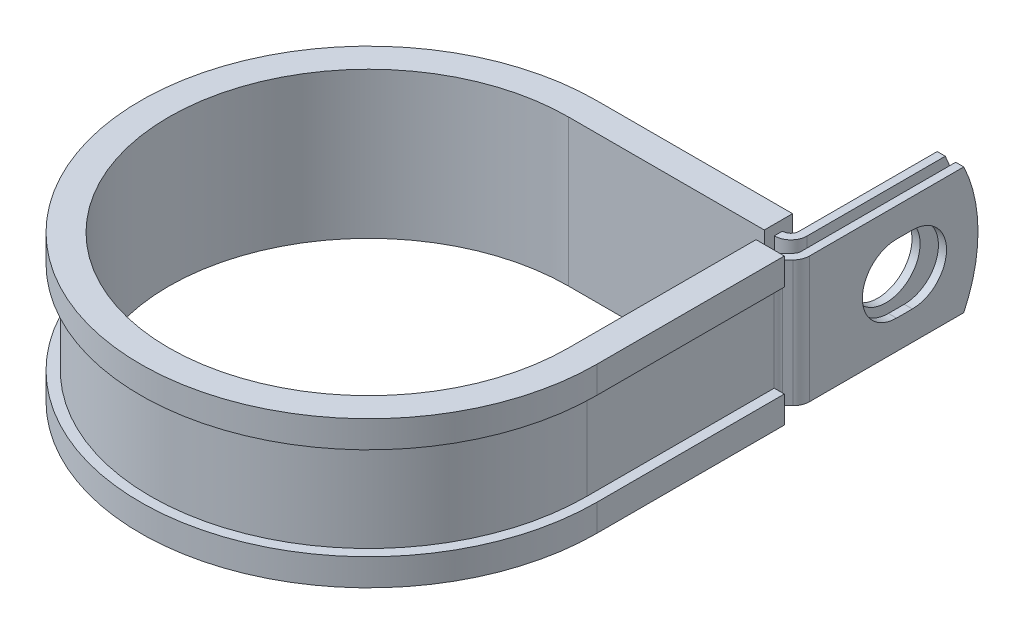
ISO-10303-21;
HEADER;
FILE_DESCRIPTION(('STEP AP214'),'2;1');
FILE_NAME('part.step','',(''),(''),'','','');
FILE_SCHEMA(('AUTOMOTIVE_DESIGN { 1 0 10303 214 1 1 1 1 }'));
ENDSEC;
DATA;
#1=APPLICATION_CONTEXT('core data for automotive mechanical design processes');
#2=APPLICATION_PROTOCOL_DEFINITION('international standard','automotive_design',2000,#1);
#3=PRODUCT_CONTEXT('',#1,'mechanical');
#4=PRODUCT('Part','Part','',(#3));
#5=PRODUCT_RELATED_PRODUCT_CATEGORY('part','',(#4));
#6=PRODUCT_DEFINITION_FORMATION('','',#4);
#7=PRODUCT_DEFINITION_CONTEXT('part definition',#1,'design');
#8=PRODUCT_DEFINITION('design','',#6,#7);
#9=PRODUCT_DEFINITION_SHAPE('','',#8);
#10=(LENGTH_UNIT() NAMED_UNIT(*) SI_UNIT(.MILLI.,.METRE.));
#11=(NAMED_UNIT(*) PLANE_ANGLE_UNIT() SI_UNIT($,.RADIAN.));
#12=(NAMED_UNIT(*) SI_UNIT($,.STERADIAN.) SOLID_ANGLE_UNIT());
#13=UNCERTAINTY_MEASURE_WITH_UNIT(LENGTH_MEASURE(1.E-05),#10,'distance_accuracy_value','');
#14=(GEOMETRIC_REPRESENTATION_CONTEXT(3) GLOBAL_UNCERTAINTY_ASSIGNED_CONTEXT((#13)) GLOBAL_UNIT_ASSIGNED_CONTEXT((#10,
#11,#12)) REPRESENTATION_CONTEXT('',''));
#15=CARTESIAN_POINT('',(0.,0.,0.));
#16=DIRECTION('',(0.,0.,1.));
#17=DIRECTION('',(1.,0.,0.));
#18=AXIS2_PLACEMENT_3D('',#15,#16,#17);
#19=CARTESIAN_POINT('',(32.3647698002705,-9.525,-31.6865));
#20=DIRECTION('',(0.,1.,0.));
#21=DIRECTION('',(1.,0.,0.));
#22=AXIS2_PLACEMENT_3D('',#19,#20,#21);
#23=PLANE('',#22);
#24=DIRECTION('',(0.,0.,-1.));
#25=VECTOR('',#24,1.);
#26=CARTESIAN_POINT('',(29.5199698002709,-9.525,-31.6865));
#27=LINE('',#26,#25);
#28=CARTESIAN_POINT('',(29.5199698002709,-9.525,-31.6865));
#29=VERTEX_POINT('',#28);
#30=CARTESIAN_POINT('',(29.5199698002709,-9.525,-32.9057));
#31=VERTEX_POINT('',#30);
#32=EDGE_CURVE('E523',#29,#31,#27,.T.);
#33=ORIENTED_EDGE('',*,*,#32,.T.);
#34=DIRECTION('',(1.,0.,0.));
#35=VECTOR('',#34,1.);
#36=CARTESIAN_POINT('',(0.,-9.525,-32.9057));
#37=LINE('',#36,#35);
#38=CARTESIAN_POINT('',(29.5707698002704,-9.525,-32.9057));
#39=VERTEX_POINT('',#38);
#40=EDGE_CURVE('E410',#39,#31,#37,.F.);
#41=ORIENTED_EDGE('',*,*,#40,.F.);
#42=CARTESIAN_POINT('',(29.5707698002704,-9.525,-34.1249));
#43=DIRECTION('',(0.,1.,0.));
#44=DIRECTION('',(1.,0.,0.));
#45=AXIS2_PLACEMENT_3D('',#42,#43,#44);
#46=CIRCLE('',#45,1.2192);
#47=CARTESIAN_POINT('',(30.7899698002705,-9.525,-34.1249));
#48=VERTEX_POINT('',#47);
#49=EDGE_CURVE('E408',#48,#39,#46,.F.);
#50=ORIENTED_EDGE('',*,*,#49,.F.);
#51=DIRECTION('',(0.,0.,1.));
#52=VECTOR('',#51,1.);
#53=CARTESIAN_POINT('',(30.7899698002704,-9.525,-57.1246));
#54=LINE('',#53,#52);
#55=CARTESIAN_POINT('',(30.7899698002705,-9.525,-54.9800631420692));
#56=VERTEX_POINT('',#55);
#57=EDGE_CURVE('E406',#56,#48,#54,.T.);
#58=ORIENTED_EDGE('',*,*,#57,.F.);
#59=DIRECTION('',(-1.,0.,0.));
#60=VECTOR('',#59,1.);
#61=CARTESIAN_POINT('',(34.8031698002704,-9.525,-54.9800631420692));
#62=LINE('',#61,#60);
#63=CARTESIAN_POINT('',(32.0091698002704,-9.525,-54.9800631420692));
#64=VERTEX_POINT('',#63);
#65=EDGE_CURVE('E12',#64,#56,#62,.T.);
#66=ORIENTED_EDGE('',*,*,#65,.F.);
#67=DIRECTION('',(0.,0.,1.));
#68=VECTOR('',#67,1.);
#69=CARTESIAN_POINT('',(32.0091698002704,-9.525,-57.1246));
#70=LINE('',#69,#68);
#71=CARTESIAN_POINT('',(32.0091698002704,-9.525,-34.1249));
#72=VERTEX_POINT('',#71);
#73=EDGE_CURVE('E404',#64,#72,#70,.T.);
#74=ORIENTED_EDGE('',*,*,#73,.T.);
#75=CARTESIAN_POINT('',(29.5707698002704,-9.525,-34.1249));
#76=DIRECTION('',(0.,-1.,0.));
#77=DIRECTION('',(0.,0.,1.));
#78=AXIS2_PLACEMENT_3D('',#75,#76,#77);
#79=CIRCLE('',#78,2.4384);
#80=CARTESIAN_POINT('',(29.5707698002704,-9.525,-31.6865));
#81=VERTEX_POINT('',#80);
#82=EDGE_CURVE('E401',#72,#81,#79,.T.);
#83=ORIENTED_EDGE('',*,*,#82,.T.);
#84=DIRECTION('',(-1.,0.,0.));
#85=VECTOR('',#84,1.);
#86=CARTESIAN_POINT('',(0.,-9.525,-31.6865));
#87=LINE('',#86,#85);
#88=EDGE_CURVE('E398',#81,#29,#87,.T.);
#89=ORIENTED_EDGE('',*,*,#88,.T.);
#90=EDGE_LOOP('',(#33,#41,#50,#58,#66,#74,#83,#89));
#91=FACE_BOUND('',#90,.T.);
#92=ADVANCED_FACE('F54',(#91),#23,.F.);
#93=CARTESIAN_POINT('',(32.3647698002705,9.525,-31.6865));
#94=DIRECTION('',(0.,1.,0.));
#95=DIRECTION('',(1.,0.,0.));
#96=AXIS2_PLACEMENT_3D('',#93,#94,#95);
#97=PLANE('',#96);
#98=DIRECTION('',(1.,0.,0.));
#99=VECTOR('',#98,1.);
#100=CARTESIAN_POINT('',(0.,9.525,-32.9057));
#101=LINE('',#100,#99);
#102=CARTESIAN_POINT('',(29.5707698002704,9.525,-32.9057));
#103=VERTEX_POINT('',#102);
#104=CARTESIAN_POINT('',(29.5199698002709,9.525,-32.9057));
#105=VERTEX_POINT('',#104);
#106=EDGE_CURVE('E368',#103,#105,#101,.F.);
#107=ORIENTED_EDGE('',*,*,#106,.T.);
#108=DIRECTION('',(0.,0.,1.));
#109=VECTOR('',#108,1.);
#110=CARTESIAN_POINT('',(29.5199698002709,9.525,-32.9057));
#111=LINE('',#110,#109);
#112=CARTESIAN_POINT('',(29.5199698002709,9.525,-31.6865));
#113=VERTEX_POINT('',#112);
#114=EDGE_CURVE('E517',#105,#113,#111,.T.);
#115=ORIENTED_EDGE('',*,*,#114,.T.);
#116=DIRECTION('',(-1.,0.,0.));
#117=VECTOR('',#116,1.);
#118=CARTESIAN_POINT('',(0.,9.525,-31.6865));
#119=LINE('',#118,#117);
#120=CARTESIAN_POINT('',(29.5707698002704,9.525,-31.6865));
#121=VERTEX_POINT('',#120);
#122=EDGE_CURVE('E625',#121,#113,#119,.T.);
#123=ORIENTED_EDGE('',*,*,#122,.F.);
#124=CARTESIAN_POINT('',(29.5707698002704,9.525,-34.1249));
#125=DIRECTION('',(0.,-1.,0.));
#126=DIRECTION('',(0.,0.,1.));
#127=AXIS2_PLACEMENT_3D('',#124,#125,#126);
#128=CIRCLE('',#127,2.4384);
#129=CARTESIAN_POINT('',(32.0091698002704,9.525,-34.1249));
#130=VERTEX_POINT('',#129);
#131=EDGE_CURVE('E370',#130,#121,#128,.T.);
#132=ORIENTED_EDGE('',*,*,#131,.F.);
#133=DIRECTION('',(0.,0.,1.));
#134=VECTOR('',#133,1.);
#135=CARTESIAN_POINT('',(32.0091698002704,9.525,-57.1246));
#136=LINE('',#135,#134);
#137=CARTESIAN_POINT('',(32.0091698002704,9.525,-54.9800631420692));
#138=VERTEX_POINT('',#137);
#139=EDGE_CURVE('E361',#138,#130,#136,.T.);
#140=ORIENTED_EDGE('',*,*,#139,.F.);
#141=DIRECTION('',(-1.,0.,0.));
#142=VECTOR('',#141,1.);
#143=CARTESIAN_POINT('',(34.8031698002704,9.525,-54.9800631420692));
#144=LINE('',#143,#142);
#145=CARTESIAN_POINT('',(30.7899698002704,9.525,-54.9800631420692));
#146=VERTEX_POINT('',#145);
#147=EDGE_CURVE('E62',#138,#146,#144,.T.);
#148=ORIENTED_EDGE('',*,*,#147,.T.);
#149=DIRECTION('',(0.,0.,1.));
#150=VECTOR('',#149,1.);
#151=CARTESIAN_POINT('',(30.7899698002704,9.525,-57.1246));
#152=LINE('',#151,#150);
#153=CARTESIAN_POINT('',(30.7899698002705,9.525,-34.1249));
#154=VERTEX_POINT('',#153);
#155=EDGE_CURVE('E358',#146,#154,#152,.T.);
#156=ORIENTED_EDGE('',*,*,#155,.T.);
#157=CARTESIAN_POINT('',(29.5707698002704,9.525,-34.1249));
#158=DIRECTION('',(0.,1.,0.));
#159=DIRECTION('',(1.,0.,0.));
#160=AXIS2_PLACEMENT_3D('',#157,#158,#159);
#161=CIRCLE('',#160,1.2192);
#162=EDGE_CURVE('E366',#154,#103,#161,.F.);
#163=ORIENTED_EDGE('',*,*,#162,.T.);
#164=EDGE_LOOP('',(#107,#115,#123,#132,#140,#148,#156,#163));
#165=FACE_BOUND('',#164,.T.);
#166=ADVANCED_FACE('F357',(#165),#97,.T.);
#167=CARTESIAN_POINT('',(0.,9.525,-31.6865));
#168=DIRECTION('',(0.,0.,1.));
#169=DIRECTION('',(1.,0.,0.));
#170=AXIS2_PLACEMENT_3D('',#167,#168,#169);
#171=PLANE('',#170);
#172=ORIENTED_EDGE('',*,*,#122,.T.);
#173=DIRECTION('',(0.,-1.,0.));
#174=VECTOR('',#173,1.);
#175=CARTESIAN_POINT('',(29.5199698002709,9.525,-31.6865));
#176=LINE('',#175,#174);
#177=EDGE_CURVE('E520',#113,#29,#176,.T.);
#178=ORIENTED_EDGE('',*,*,#177,.T.);
#179=ORIENTED_EDGE('',*,*,#88,.F.);
#180=DIRECTION('',(0.,-1.,0.));
#181=VECTOR('',#180,1.);
#182=CARTESIAN_POINT('',(29.5707698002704,9.525,-31.6865));
#183=LINE('',#182,#181);
#184=EDGE_CURVE('E344',#121,#81,#183,.T.);
#185=ORIENTED_EDGE('',*,*,#184,.F.);
#186=EDGE_LOOP('',(#172,#178,#179,#185));
#187=FACE_BOUND('',#186,.T.);
#188=ADVANCED_FACE('F635',(#187),#171,.T.);
#189=CARTESIAN_POINT('',(34.8031698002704,9.525,-31.6865));
#190=DIRECTION('',(-1.,0.,0.));
#191=DIRECTION('',(0.,0.,1.));
#192=AXIS2_PLACEMENT_3D('',#189,#190,#191);
#193=PLANE('',#192);
#194=CARTESIAN_POINT('',(34.8031698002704,0.,-47.2185999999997));
#195=DIRECTION('',(1.,0.,0.));
#196=DIRECTION('',(0.,0.,-1.));
#197=AXIS2_PLACEMENT_3D('',#194,#195,#196);
#198=CIRCLE('',#197,5.1562);
#199=CARTESIAN_POINT('',(34.8031698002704,-5.1562,-47.2186000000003));
#200=VERTEX_POINT('',#199);
#201=CARTESIAN_POINT('',(34.8031698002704,5.1562,-47.2186000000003));
#202=VERTEX_POINT('',#201);
#203=EDGE_CURVE('E580',#200,#202,#198,.T.);
#204=ORIENTED_EDGE('',*,*,#203,.F.);
#205=DIRECTION('',(0.,0.,-1.));
#206=VECTOR('',#205,1.);
#207=CARTESIAN_POINT('',(34.8031698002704,-5.1562,-44.8309999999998));
#208=LINE('',#207,#206);
#209=CARTESIAN_POINT('',(34.8031698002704,-5.1562,-44.8309999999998));
#210=VERTEX_POINT('',#209);
#211=EDGE_CURVE('E583',#210,#200,#208,.T.);
#212=ORIENTED_EDGE('',*,*,#211,.F.);
#213=CARTESIAN_POINT('',(34.8031698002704,0.,-44.8309999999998));
#214=DIRECTION('',(1.,0.,0.));
#215=DIRECTION('',(0.,0.,-1.));
#216=AXIS2_PLACEMENT_3D('',#213,#214,#215);
#217=CIRCLE('',#216,5.1562);
#218=CARTESIAN_POINT('',(34.8031698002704,5.1562,-44.8309999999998));
#219=VERTEX_POINT('',#218);
#220=EDGE_CURVE('E576',#219,#210,#217,.T.);
#221=ORIENTED_EDGE('',*,*,#220,.F.);
#222=DIRECTION('',(0.,0.,1.));
#223=VECTOR('',#222,1.);
#224=CARTESIAN_POINT('',(34.8031698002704,5.1562,-44.8309999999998));
#225=LINE('',#224,#223);
#226=EDGE_CURVE('E577',#202,#219,#225,.T.);
#227=ORIENTED_EDGE('',*,*,#226,.F.);
#228=EDGE_LOOP('',(#204,#212,#221,#227));
#229=FACE_BOUND('',#228,.T.);
#230=DIRECTION('',(0.,0.,-1.));
#231=VECTOR('',#230,1.);
#232=CARTESIAN_POINT('',(34.8031698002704,-9.525,-31.6865));
#233=LINE('',#232,#231);
#234=CARTESIAN_POINT('',(34.8031698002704,-9.525,-31.6865));
#235=VERTEX_POINT('',#234);
#236=CARTESIAN_POINT('',(34.8031698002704,-9.525,-54.9800631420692));
#237=VERTEX_POINT('',#236);
#238=EDGE_CURVE('E382',#235,#237,#233,.T.);
#239=ORIENTED_EDGE('',*,*,#238,.T.);
#240=CARTESIAN_POINT('',(34.8031698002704,0.,-34.8996));
#241=DIRECTION('',(-1.,0.,0.));
#242=DIRECTION('',(0.,0.,1.));
#243=AXIS2_PLACEMENT_3D('',#240,#241,#242);
#244=CIRCLE('',#243,22.225);
#245=CARTESIAN_POINT('',(34.8031698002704,9.525,-54.9800631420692));
#246=VERTEX_POINT('',#245);
#247=EDGE_CURVE('E568',#246,#237,#244,.T.);
#248=ORIENTED_EDGE('',*,*,#247,.F.);
#249=DIRECTION('',(0.,0.,-1.));
#250=VECTOR('',#249,1.);
#251=CARTESIAN_POINT('',(34.8031698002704,9.525,-31.6865));
#252=LINE('',#251,#250);
#253=CARTESIAN_POINT('',(34.8031698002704,9.525,-31.6865));
#254=VERTEX_POINT('',#253);
#255=EDGE_CURVE('E419',#254,#246,#252,.T.);
#256=ORIENTED_EDGE('',*,*,#255,.F.);
#257=DIRECTION('',(0.,-1.,0.));
#258=VECTOR('',#257,1.);
#259=CARTESIAN_POINT('',(34.8031698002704,9.525,-31.6865));
#260=LINE('',#259,#258);
#261=EDGE_CURVE('E381',#254,#235,#260,.T.);
#262=ORIENTED_EDGE('',*,*,#261,.T.);
#263=EDGE_LOOP('',(#239,#248,#256,#262));
#264=FACE_BOUND('',#263,.T.);
#265=ADVANCED_FACE('F56',(#229,#264),#193,.F.);
#266=CARTESIAN_POINT('',(33.5839698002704,9.525,-31.6865));
#267=DIRECTION('',(-1.,0.,0.));
#268=DIRECTION('',(0.,0.,1.));
#269=AXIS2_PLACEMENT_3D('',#266,#267,#268);
#270=PLANE('',#269);
#271=DIRECTION('',(0.,0.,-1.));
#272=VECTOR('',#271,1.);
#273=CARTESIAN_POINT('',(33.5839698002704,-5.1562,-44.8309999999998));
#274=LINE('',#273,#272);
#275=CARTESIAN_POINT('',(33.5839698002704,-5.1562,-44.8309999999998));
#276=VERTEX_POINT('',#275);
#277=CARTESIAN_POINT('',(33.5839698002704,-5.1562,-47.2186000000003));
#278=VERTEX_POINT('',#277);
#279=EDGE_CURVE('E579',#276,#278,#274,.T.);
#280=ORIENTED_EDGE('',*,*,#279,.T.);
#281=CARTESIAN_POINT('',(33.5839698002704,0.,-47.2185999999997));
#282=DIRECTION('',(-1.,0.,0.));
#283=DIRECTION('',(0.,0.,1.));
#284=AXIS2_PLACEMENT_3D('',#281,#282,#283);
#285=CIRCLE('',#284,5.1562);
#286=CARTESIAN_POINT('',(33.5839698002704,5.1562,-47.2186000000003));
#287=VERTEX_POINT('',#286);
#288=EDGE_CURVE('E600',#278,#287,#285,.F.);
#289=ORIENTED_EDGE('',*,*,#288,.T.);
#290=DIRECTION('',(0.,0.,1.));
#291=VECTOR('',#290,1.);
#292=CARTESIAN_POINT('',(33.5839698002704,5.1562,-44.8309999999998));
#293=LINE('',#292,#291);
#294=CARTESIAN_POINT('',(33.5839698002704,5.1562,-44.8309999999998));
#295=VERTEX_POINT('',#294);
#296=EDGE_CURVE('E596',#287,#295,#293,.T.);
#297=ORIENTED_EDGE('',*,*,#296,.T.);
#298=CARTESIAN_POINT('',(33.5839698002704,0.,-44.8309999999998));
#299=DIRECTION('',(-1.,0.,0.));
#300=DIRECTION('',(0.,0.,1.));
#301=AXIS2_PLACEMENT_3D('',#298,#299,#300);
#302=CIRCLE('',#301,5.1562);
#303=EDGE_CURVE('E591',#295,#276,#302,.F.);
#304=ORIENTED_EDGE('',*,*,#303,.T.);
#305=EDGE_LOOP('',(#280,#289,#297,#304));
#306=FACE_BOUND('',#305,.T.);
#307=CARTESIAN_POINT('',(33.5839698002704,0.,-34.8996));
#308=DIRECTION('',(-1.,0.,0.));
#309=DIRECTION('',(0.,0.,1.));
#310=AXIS2_PLACEMENT_3D('',#307,#308,#309);
#311=CIRCLE('',#310,22.225);
#312=CARTESIAN_POINT('',(33.5839698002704,9.525,-54.9800631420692));
#313=VERTEX_POINT('',#312);
#314=CARTESIAN_POINT('',(33.5839698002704,-9.525,-54.9800631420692));
#315=VERTEX_POINT('',#314);
#316=EDGE_CURVE('E76',#313,#315,#311,.T.);
#317=ORIENTED_EDGE('',*,*,#316,.T.);
#318=DIRECTION('',(0.,0.,-1.));
#319=VECTOR('',#318,1.);
#320=CARTESIAN_POINT('',(33.5839698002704,-9.525,-31.6865));
#321=LINE('',#320,#319);
#322=CARTESIAN_POINT('',(33.5839698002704,-9.525,-31.6865));
#323=VERTEX_POINT('',#322);
#324=EDGE_CURVE('E385',#323,#315,#321,.T.);
#325=ORIENTED_EDGE('',*,*,#324,.F.);
#326=DIRECTION('',(0.,-1.,0.));
#327=VECTOR('',#326,1.);
#328=CARTESIAN_POINT('',(33.5839698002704,9.525,-31.6865));
#329=LINE('',#328,#327);
#330=CARTESIAN_POINT('',(33.5839698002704,9.525,-31.6865));
#331=VERTEX_POINT('',#330);
#332=EDGE_CURVE('E352',#331,#323,#329,.T.);
#333=ORIENTED_EDGE('',*,*,#332,.F.);
#334=DIRECTION('',(0.,0.,-1.));
#335=VECTOR('',#334,1.);
#336=CARTESIAN_POINT('',(33.5839698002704,9.525,-31.6865));
#337=LINE('',#336,#335);
#338=EDGE_CURVE('E615',#331,#313,#337,.T.);
#339=ORIENTED_EDGE('',*,*,#338,.T.);
#340=EDGE_LOOP('',(#317,#325,#333,#339));
#341=FACE_BOUND('',#340,.T.);
#342=ADVANCED_FACE('F689',(#306,#341),#270,.T.);
#343=CARTESIAN_POINT('',(32.0091698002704,9.525,-57.1246));
#344=DIRECTION('',(1.,0.,0.));
#345=DIRECTION('',(0.,0.,-1.));
#346=AXIS2_PLACEMENT_3D('',#343,#344,#345);
#347=PLANE('',#346);
#348=CARTESIAN_POINT('',(32.0091698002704,0.,-46.0248));
#349=DIRECTION('',(1.,0.,0.));
#350=DIRECTION('',(0.,0.,-1.));
#351=AXIS2_PLACEMENT_3D('',#348,#349,#350);
#352=CIRCLE('',#351,5.1562);
#353=CARTESIAN_POINT('',(32.0091698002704,0.,-51.181));
#354=VERTEX_POINT('',#353);
#355=EDGE_CURVE('E386',#354,#354,#352,.F.);
#356=ORIENTED_EDGE('',*,*,#355,.T.);
#357=EDGE_LOOP('',(#356));
#358=FACE_BOUND('',#357,.T.);
#359=ORIENTED_EDGE('',*,*,#73,.F.);
#360=CARTESIAN_POINT('',(32.0091698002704,0.,-34.8996));
#361=DIRECTION('',(1.,0.,0.));
#362=DIRECTION('',(0.,0.,-1.));
#363=AXIS2_PLACEMENT_3D('',#360,#361,#362);
#364=CIRCLE('',#363,22.225);
#365=EDGE_CURVE('E573',#64,#138,#364,.T.);
#366=ORIENTED_EDGE('',*,*,#365,.T.);
#367=ORIENTED_EDGE('',*,*,#139,.T.);
#368=DIRECTION('',(0.,-1.,0.));
#369=VECTOR('',#368,1.);
#370=CARTESIAN_POINT('',(32.0091698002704,9.525,-34.1249));
#371=LINE('',#370,#369);
#372=EDGE_CURVE('E341',#130,#72,#371,.T.);
#373=ORIENTED_EDGE('',*,*,#372,.T.);
#374=EDGE_LOOP('',(#359,#366,#367,#373));
#375=FACE_BOUND('',#374,.T.);
#376=ADVANCED_FACE('F641',(#358,#375),#347,.T.);
#377=CARTESIAN_POINT('',(30.7899698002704,9.525,-57.1246));
#378=DIRECTION('',(1.,0.,0.));
#379=DIRECTION('',(0.,0.,-1.));
#380=AXIS2_PLACEMENT_3D('',#377,#378,#379);
#381=PLANE('',#380);
#382=CARTESIAN_POINT('',(30.7899698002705,0.,-46.0248));
#383=DIRECTION('',(-1.,0.,0.));
#384=DIRECTION('',(0.,0.,1.));
#385=AXIS2_PLACEMENT_3D('',#382,#383,#384);
#386=CIRCLE('',#385,5.1562);
#387=CARTESIAN_POINT('',(30.7899698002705,0.,-40.8686));
#388=VERTEX_POINT('',#387);
#389=EDGE_CURVE('E608',#388,#388,#386,.T.);
#390=ORIENTED_EDGE('',*,*,#389,.F.);
#391=EDGE_LOOP('',(#390));
#392=FACE_BOUND('',#391,.T.);
#393=CARTESIAN_POINT('',(30.7899698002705,0.,-34.8996));
#394=DIRECTION('',(-1.,0.,0.));
#395=DIRECTION('',(0.,0.,1.));
#396=AXIS2_PLACEMENT_3D('',#393,#394,#395);
#397=CIRCLE('',#396,22.225);
#398=EDGE_CURVE('E68',#146,#56,#397,.T.);
#399=ORIENTED_EDGE('',*,*,#398,.T.);
#400=ORIENTED_EDGE('',*,*,#57,.T.);
#401=DIRECTION('',(0.,-1.,0.));
#402=VECTOR('',#401,1.);
#403=CARTESIAN_POINT('',(30.7899698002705,9.525,-34.1249));
#404=LINE('',#403,#402);
#405=EDGE_CURVE('E338',#154,#48,#404,.T.);
#406=ORIENTED_EDGE('',*,*,#405,.F.);
#407=ORIENTED_EDGE('',*,*,#155,.F.);
#408=EDGE_LOOP('',(#399,#400,#406,#407));
#409=FACE_BOUND('',#408,.T.);
#410=ADVANCED_FACE('F364',(#392,#409),#381,.F.);
#411=CARTESIAN_POINT('',(34.1249,-9.525,-28.2740026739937));
#412=DIRECTION('',(0.,1.,0.));
#413=DIRECTION('',(1.,0.,0.));
#414=AXIS2_PLACEMENT_3D('',#411,#412,#413);
#415=CIRCLE('',#414,1.2192);
#416=CARTESIAN_POINT('',(32.9057,-9.525,-28.2740026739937));
#417=VERTEX_POINT('',#416);
#418=CARTESIAN_POINT('',(33.2627954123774,-9.525,-29.1361072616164));
#419=VERTEX_POINT('',#418);
#420=EDGE_CURVE('E413',#417,#419,#415,.F.);
#421=ORIENTED_EDGE('',*,*,#420,.F.);
#422=DIRECTION('',(1.,0.,0.));
#423=VECTOR('',#422,1.);
#424=CARTESIAN_POINT('',(31.6865,-9.525,-28.2740026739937));
#425=LINE('',#424,#423);
#426=CARTESIAN_POINT('',(31.6865,-9.525,-28.2740026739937));
#427=VERTEX_POINT('',#426);
#428=EDGE_CURVE('E451',#427,#417,#425,.T.);
#429=ORIENTED_EDGE('',*,*,#428,.F.);
#430=CARTESIAN_POINT('',(34.1249,-9.525,-28.2740026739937));
#431=DIRECTION('',(0.,-1.,0.));
#432=DIRECTION('',(0.,0.,1.));
#433=AXIS2_PLACEMENT_3D('',#430,#431,#432);
#434=CIRCLE('',#433,2.4384);
#435=CARTESIAN_POINT('',(32.4006908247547,-9.525,-29.998211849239));
#436=VERTEX_POINT('',#435);
#437=EDGE_CURVE('E395',#427,#436,#434,.T.);
#438=ORIENTED_EDGE('',*,*,#437,.T.);
#439=DIRECTION('',(0.707106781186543,0.,-0.707106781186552));
#440=VECTOR('',#439,1.);
#441=CARTESIAN_POINT('',(32.4006908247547,-9.525,-29.998211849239));
#442=LINE('',#441,#440);
#443=CARTESIAN_POINT('',(33.2268743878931,-9.525,-30.8243954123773));
#444=VERTEX_POINT('',#443);
#445=EDGE_CURVE('E392',#436,#444,#442,.T.);
#446=ORIENTED_EDGE('',*,*,#445,.T.);
#447=CARTESIAN_POINT('',(32.3647698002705,-9.525,-31.6865));
#448=DIRECTION('',(0.,1.,0.));
#449=DIRECTION('',(0.,0.,1.));
#450=AXIS2_PLACEMENT_3D('',#447,#448,#449);
#451=CIRCLE('',#450,1.21919999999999);
#452=EDGE_CURVE('E389',#444,#323,#451,.T.);
#453=ORIENTED_EDGE('',*,*,#452,.T.);
#454=ORIENTED_EDGE('',*,*,#324,.T.);
#455=DIRECTION('',(-1.,0.,0.));
#456=VECTOR('',#455,1.);
#457=CARTESIAN_POINT('',(34.8031698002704,-9.525,-54.9800631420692));
#458=LINE('',#457,#456);
#459=EDGE_CURVE('E566',#237,#315,#458,.T.);
#460=ORIENTED_EDGE('',*,*,#459,.F.);
#461=ORIENTED_EDGE('',*,*,#238,.F.);
#462=CARTESIAN_POINT('',(32.3647698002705,-9.525,-31.6865));
#463=DIRECTION('',(0.,1.,0.));
#464=DIRECTION('',(1.,0.,0.));
#465=AXIS2_PLACEMENT_3D('',#462,#463,#464);
#466=CIRCLE('',#465,2.43839999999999);
#467=CARTESIAN_POINT('',(34.0889789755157,-9.525,-29.9622908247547));
#468=VERTEX_POINT('',#467);
#469=EDGE_CURVE('E417',#468,#235,#466,.T.);
#470=ORIENTED_EDGE('',*,*,#469,.F.);
#471=DIRECTION('',(0.707106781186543,0.,-0.707106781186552));
#472=VECTOR('',#471,1.);
#473=CARTESIAN_POINT('',(33.2627954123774,-9.525,-29.1361072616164));
#474=LINE('',#473,#472);
#475=EDGE_CURVE('E415',#419,#468,#474,.T.);
#476=ORIENTED_EDGE('',*,*,#475,.F.);
#477=EDGE_LOOP('',(#421,#429,#438,#446,#453,#454,#460,#461,#470,#476));
#478=FACE_BOUND('',#477,.T.);
#479=ADVANCED_FACE('F675',(#478),#23,.F.);
#480=DIRECTION('',(-1.,0.,0.));
#481=VECTOR('',#480,1.);
#482=CARTESIAN_POINT('',(32.9057,9.525,-28.2740026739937));
#483=LINE('',#482,#481);
#484=CARTESIAN_POINT('',(32.9057,9.525,-28.2740026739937));
#485=VERTEX_POINT('',#484);
#486=CARTESIAN_POINT('',(31.6865,9.525,-28.2740026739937));
#487=VERTEX_POINT('',#486);
#488=EDGE_CURVE('E440',#485,#487,#483,.T.);
#489=ORIENTED_EDGE('',*,*,#488,.F.);
#490=CARTESIAN_POINT('',(34.1249,9.525,-28.2740026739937));
#491=DIRECTION('',(0.,1.,0.));
#492=DIRECTION('',(1.,0.,0.));
#493=AXIS2_PLACEMENT_3D('',#490,#491,#492);
#494=CIRCLE('',#493,1.2192);
#495=CARTESIAN_POINT('',(33.2627954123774,9.525,-29.1361072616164));
#496=VERTEX_POINT('',#495);
#497=EDGE_CURVE('E375',#485,#496,#494,.F.);
#498=ORIENTED_EDGE('',*,*,#497,.T.);
#499=DIRECTION('',(0.707106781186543,0.,-0.707106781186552));
#500=VECTOR('',#499,1.);
#501=CARTESIAN_POINT('',(33.2627954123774,9.525,-29.1361072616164));
#502=LINE('',#501,#500);
#503=CARTESIAN_POINT('',(34.0889789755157,9.525,-29.9622908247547));
#504=VERTEX_POINT('',#503);
#505=EDGE_CURVE('E377',#496,#504,#502,.T.);
#506=ORIENTED_EDGE('',*,*,#505,.T.);
#507=CARTESIAN_POINT('',(32.3647698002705,9.525,-31.6865));
#508=DIRECTION('',(0.,1.,0.));
#509=DIRECTION('',(1.,0.,0.));
#510=AXIS2_PLACEMENT_3D('',#507,#508,#509);
#511=CIRCLE('',#510,2.43839999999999);
#512=EDGE_CURVE('E379',#504,#254,#511,.T.);
#513=ORIENTED_EDGE('',*,*,#512,.T.);
#514=ORIENTED_EDGE('',*,*,#255,.T.);
#515=DIRECTION('',(-1.,0.,0.));
#516=VECTOR('',#515,1.);
#517=CARTESIAN_POINT('',(34.8031698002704,9.525,-54.9800631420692));
#518=LINE('',#517,#516);
#519=EDGE_CURVE('E570',#246,#313,#518,.T.);
#520=ORIENTED_EDGE('',*,*,#519,.T.);
#521=ORIENTED_EDGE('',*,*,#338,.F.);
#522=CARTESIAN_POINT('',(32.3647698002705,9.525,-31.6865));
#523=DIRECTION('',(0.,1.,0.));
#524=DIRECTION('',(0.,0.,1.));
#525=AXIS2_PLACEMENT_3D('',#522,#523,#524);
#526=CIRCLE('',#525,1.21919999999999);
#527=CARTESIAN_POINT('',(33.2268743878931,9.525,-30.8243954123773));
#528=VERTEX_POINT('',#527);
#529=EDGE_CURVE('E618',#528,#331,#526,.T.);
#530=ORIENTED_EDGE('',*,*,#529,.F.);
#531=DIRECTION('',(0.707106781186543,0.,-0.707106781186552));
#532=VECTOR('',#531,1.);
#533=CARTESIAN_POINT('',(32.4006908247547,9.525,-29.998211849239));
#534=LINE('',#533,#532);
#535=CARTESIAN_POINT('',(32.4006908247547,9.525,-29.998211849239));
#536=VERTEX_POINT('',#535);
#537=EDGE_CURVE('E621',#536,#528,#534,.T.);
#538=ORIENTED_EDGE('',*,*,#537,.F.);
#539=CARTESIAN_POINT('',(34.1249,9.525,-28.2740026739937));
#540=DIRECTION('',(0.,-1.,0.));
#541=DIRECTION('',(0.,0.,1.));
#542=AXIS2_PLACEMENT_3D('',#539,#540,#541);
#543=CIRCLE('',#542,2.4384);
#544=EDGE_CURVE('E450',#487,#536,#543,.T.);
#545=ORIENTED_EDGE('',*,*,#544,.F.);
#546=EDGE_LOOP('',(#489,#498,#506,#513,#514,#520,#521,#530,#538,#545));
#547=FACE_BOUND('',#546,.T.);
#548=ADVANCED_FACE('F447',(#547),#97,.T.);
#549=CARTESIAN_POINT('',(32.3647698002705,9.525,-31.6865));
#550=DIRECTION('',(0.,-1.,0.));
#551=DIRECTION('',(0.,0.,-1.));
#552=AXIS2_PLACEMENT_3D('',#549,#550,#551);
#553=CYLINDRICAL_SURFACE('',#552,1.21919999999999);
#554=ORIENTED_EDGE('',*,*,#452,.F.);
#555=DIRECTION('',(0.,-1.,0.));
#556=VECTOR('',#555,1.);
#557=CARTESIAN_POINT('',(33.2268743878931,9.525,-30.8243954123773));
#558=LINE('',#557,#556);
#559=EDGE_CURVE('E350',#528,#444,#558,.T.);
#560=ORIENTED_EDGE('',*,*,#559,.F.);
#561=ORIENTED_EDGE('',*,*,#529,.T.);
#562=ORIENTED_EDGE('',*,*,#332,.T.);
#563=EDGE_LOOP('',(#554,#560,#561,#562));
#564=FACE_BOUND('',#563,.T.);
#565=ADVANCED_FACE('F685',(#564),#553,.F.);
#566=CARTESIAN_POINT('',(32.4006908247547,9.525,-29.998211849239));
#567=DIRECTION('',(-0.707106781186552,0.,-0.707106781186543));
#568=DIRECTION('',(-0.707106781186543,0.,0.707106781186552));
#569=AXIS2_PLACEMENT_3D('',#566,#567,#568);
#570=PLANE('',#569);
#571=ORIENTED_EDGE('',*,*,#445,.F.);
#572=DIRECTION('',(0.,-1.,0.));
#573=VECTOR('',#572,1.);
#574=CARTESIAN_POINT('',(32.4006908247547,9.525,-29.998211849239));
#575=LINE('',#574,#573);
#576=EDGE_CURVE('E348',#536,#436,#575,.T.);
#577=ORIENTED_EDGE('',*,*,#576,.F.);
#578=ORIENTED_EDGE('',*,*,#537,.T.);
#579=ORIENTED_EDGE('',*,*,#559,.T.);
#580=EDGE_LOOP('',(#571,#577,#578,#579));
#581=FACE_BOUND('',#580,.T.);
#582=ADVANCED_FACE('F680',(#581),#570,.T.);
#583=CARTESIAN_POINT('',(34.1249,9.525,-28.2740026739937));
#584=DIRECTION('',(0.,-1.,0.));
#585=DIRECTION('',(0.,0.,-1.));
#586=AXIS2_PLACEMENT_3D('',#583,#584,#585);
#587=CYLINDRICAL_SURFACE('',#586,2.4384);
#588=ORIENTED_EDGE('',*,*,#437,.F.);
#589=DIRECTION('',(0.,-1.,0.));
#590=VECTOR('',#589,1.);
#591=CARTESIAN_POINT('',(31.6865,9.525,-28.2740026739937));
#592=LINE('',#591,#590);
#593=EDGE_CURVE('E346',#487,#427,#592,.T.);
#594=ORIENTED_EDGE('',*,*,#593,.F.);
#595=ORIENTED_EDGE('',*,*,#544,.T.);
#596=ORIENTED_EDGE('',*,*,#576,.T.);
#597=EDGE_LOOP('',(#588,#594,#595,#596));
#598=FACE_BOUND('',#597,.T.);
#599=ADVANCED_FACE('F677',(#598),#587,.T.);
#600=CARTESIAN_POINT('',(29.5707698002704,9.525,-34.1249));
#601=DIRECTION('',(0.,-1.,0.));
#602=DIRECTION('',(0.,0.,-1.));
#603=AXIS2_PLACEMENT_3D('',#600,#601,#602);
#604=CYLINDRICAL_SURFACE('',#603,2.4384);
#605=ORIENTED_EDGE('',*,*,#82,.F.);
#606=ORIENTED_EDGE('',*,*,#372,.F.);
#607=ORIENTED_EDGE('',*,*,#131,.T.);
#608=ORIENTED_EDGE('',*,*,#184,.T.);
#609=EDGE_LOOP('',(#605,#606,#607,#608));
#610=FACE_BOUND('',#609,.T.);
#611=ADVANCED_FACE('F631',(#610),#604,.T.);
#612=CARTESIAN_POINT('',(29.5707698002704,9.525,-34.1249));
#613=DIRECTION('',(0.,-1.,0.));
#614=DIRECTION('',(0.,0.,-1.));
#615=AXIS2_PLACEMENT_3D('',#612,#613,#614);
#616=CYLINDRICAL_SURFACE('',#615,1.2192);
#617=ORIENTED_EDGE('',*,*,#49,.T.);
#618=DIRECTION('',(0.,-1.,0.));
#619=VECTOR('',#618,1.);
#620=CARTESIAN_POINT('',(29.5707698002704,9.525,-32.9057));
#621=LINE('',#620,#619);
#622=EDGE_CURVE('E329',#103,#39,#621,.T.);
#623=ORIENTED_EDGE('',*,*,#622,.F.);
#624=ORIENTED_EDGE('',*,*,#162,.F.);
#625=ORIENTED_EDGE('',*,*,#405,.T.);
#626=EDGE_LOOP('',(#617,#623,#624,#625));
#627=FACE_BOUND('',#626,.T.);
#628=ADVANCED_FACE('F646',(#627),#616,.F.);
#629=CARTESIAN_POINT('',(0.,9.525,-32.9057));
#630=DIRECTION('',(0.,0.,1.));
#631=DIRECTION('',(1.,0.,0.));
#632=AXIS2_PLACEMENT_3D('',#629,#630,#631);
#633=PLANE('',#632);
#634=DIRECTION('',(0.,-1.,0.));
#635=VECTOR('',#634,1.);
#636=CARTESIAN_POINT('',(0.,9.525,-32.9057));
#637=LINE('',#636,#635);
#638=CARTESIAN_POINT('',(4.61573442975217E-13,6.985,-32.9057));
#639=VERTEX_POINT('',#638);
#640=CARTESIAN_POINT('',(4.61573442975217E-13,-6.985,-32.9057));
#641=VERTEX_POINT('',#640);
#642=EDGE_CURVE('E320',#639,#641,#637,.T.);
#643=ORIENTED_EDGE('',*,*,#642,.F.);
#644=DIRECTION('',(1.,0.,0.));
#645=VECTOR('',#644,1.);
#646=CARTESIAN_POINT('',(4.61573442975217E-13,6.985,-32.9057));
#647=LINE('',#646,#645);
#648=CARTESIAN_POINT('',(29.5199698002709,6.985,-32.9057));
#649=VERTEX_POINT('',#648);
#650=EDGE_CURVE('E563',#639,#649,#647,.T.);
#651=ORIENTED_EDGE('',*,*,#650,.T.);
#652=DIRECTION('',(0.,1.,0.));
#653=VECTOR('',#652,1.);
#654=CARTESIAN_POINT('',(29.5199698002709,9.525,-32.9057));
#655=LINE('',#654,#653);
#656=EDGE_CURVE('E514',#649,#105,#655,.T.);
#657=ORIENTED_EDGE('',*,*,#656,.T.);
#658=ORIENTED_EDGE('',*,*,#106,.F.);
#659=ORIENTED_EDGE('',*,*,#622,.T.);
#660=ORIENTED_EDGE('',*,*,#40,.T.);
#661=DIRECTION('',(0.,1.,0.));
#662=VECTOR('',#661,1.);
#663=CARTESIAN_POINT('',(29.5199698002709,-9.525,-32.9057));
#664=LINE('',#663,#662);
#665=CARTESIAN_POINT('',(29.5199698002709,-6.985,-32.9057));
#666=VERTEX_POINT('',#665);
#667=EDGE_CURVE('E526',#31,#666,#664,.T.);
#668=ORIENTED_EDGE('',*,*,#667,.T.);
#669=DIRECTION('',(1.,0.,0.));
#670=VECTOR('',#669,1.);
#671=CARTESIAN_POINT('',(4.61573442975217E-13,-6.985,-32.9057));
#672=LINE('',#671,#670);
#673=EDGE_CURVE('E543',#641,#666,#672,.T.);
#674=ORIENTED_EDGE('',*,*,#673,.F.);
#675=EDGE_LOOP('',(#643,#651,#657,#658,#659,#660,#668,#674));
#676=FACE_BOUND('',#675,.T.);
#677=ADVANCED_FACE('F650',(#676),#633,.F.);
#678=CARTESIAN_POINT('',(0.,9.525,0.));
#679=DIRECTION('',(0.,-1.,0.));
#680=DIRECTION('',(0.,0.,-1.));
#681=AXIS2_PLACEMENT_3D('',#678,#679,#680);
#682=CYLINDRICAL_SURFACE('',#681,32.9057);
#683=DIRECTION('',(0.,-1.,0.));
#684=VECTOR('',#683,1.);
#685=CARTESIAN_POINT('',(32.9057,9.525,0.));
#686=LINE('',#685,#684);
#687=CARTESIAN_POINT('',(32.9057,6.985,0.));
#688=VERTEX_POINT('',#687);
#689=CARTESIAN_POINT('',(32.9057,-6.985,0.));
#690=VERTEX_POINT('',#689);
#691=EDGE_CURVE('E318',#688,#690,#686,.T.);
#692=ORIENTED_EDGE('',*,*,#691,.F.);
#693=CARTESIAN_POINT('',(0.,6.985,0.));
#694=DIRECTION('',(0.,-1.,0.));
#695=DIRECTION('',(0.,0.,-1.));
#696=AXIS2_PLACEMENT_3D('',#693,#694,#695);
#697=CIRCLE('',#696,32.9057);
#698=EDGE_CURVE('E512',#688,#639,#697,.T.);
#699=ORIENTED_EDGE('',*,*,#698,.T.);
#700=ORIENTED_EDGE('',*,*,#642,.T.);
#701=CARTESIAN_POINT('',(0.,-6.985,0.));
#702=DIRECTION('',(0.,-1.,0.));
#703=DIRECTION('',(0.,0.,-1.));
#704=AXIS2_PLACEMENT_3D('',#701,#702,#703);
#705=CIRCLE('',#704,32.9057);
#706=EDGE_CURVE('E301',#690,#641,#705,.T.);
#707=ORIENTED_EDGE('',*,*,#706,.F.);
#708=EDGE_LOOP('',(#692,#699,#700,#707));
#709=FACE_BOUND('',#708,.T.);
#710=ADVANCED_FACE('F316',(#709),#682,.T.);
#711=CARTESIAN_POINT('',(32.9057,9.525,0.));
#712=DIRECTION('',(-1.,0.,0.));
#713=DIRECTION('',(0.,0.,1.));
#714=AXIS2_PLACEMENT_3D('',#711,#712,#713);
#715=PLANE('',#714);
#716=DIRECTION('',(0.,-1.,0.));
#717=VECTOR('',#716,1.);
#718=CARTESIAN_POINT('',(32.9057,9.525,-28.2740026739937));
#719=LINE('',#718,#717);
#720=CARTESIAN_POINT('',(32.9057,6.985,-28.2740026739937));
#721=VERTEX_POINT('',#720);
#722=CARTESIAN_POINT('',(32.9057,-6.985,-28.2740026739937));
#723=VERTEX_POINT('',#722);
#724=EDGE_CURVE('E332',#721,#723,#719,.T.);
#725=ORIENTED_EDGE('',*,*,#724,.F.);
#726=DIRECTION('',(0.,0.,-1.));
#727=VECTOR('',#726,1.);
#728=CARTESIAN_POINT('',(32.9057,6.985,0.));
#729=LINE('',#728,#727);
#730=EDGE_CURVE('E326',#688,#721,#729,.T.);
#731=ORIENTED_EDGE('',*,*,#730,.F.);
#732=ORIENTED_EDGE('',*,*,#691,.T.);
#733=DIRECTION('',(0.,0.,-1.));
#734=VECTOR('',#733,1.);
#735=CARTESIAN_POINT('',(32.9057,-6.985,0.));
#736=LINE('',#735,#734);
#737=EDGE_CURVE('E297',#690,#723,#736,.T.);
#738=ORIENTED_EDGE('',*,*,#737,.T.);
#739=EDGE_LOOP('',(#725,#731,#732,#738));
#740=FACE_BOUND('',#739,.T.);
#741=ADVANCED_FACE('F325',(#740),#715,.F.);
#742=CARTESIAN_POINT('',(34.1249,9.525,-28.2740026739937));
#743=DIRECTION('',(0.,-1.,0.));
#744=DIRECTION('',(0.,0.,-1.));
#745=AXIS2_PLACEMENT_3D('',#742,#743,#744);
#746=CYLINDRICAL_SURFACE('',#745,1.2192);
#747=ORIENTED_EDGE('',*,*,#420,.T.);
#748=DIRECTION('',(0.,-1.,0.));
#749=VECTOR('',#748,1.);
#750=CARTESIAN_POINT('',(33.2627954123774,9.525,-29.1361072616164));
#751=LINE('',#750,#749);
#752=EDGE_CURVE('E424',#496,#419,#751,.T.);
#753=ORIENTED_EDGE('',*,*,#752,.F.);
#754=ORIENTED_EDGE('',*,*,#497,.F.);
#755=EDGE_CURVE('E327',#485,#721,#719,.T.);
#756=ORIENTED_EDGE('',*,*,#755,.T.);
#757=ORIENTED_EDGE('',*,*,#724,.T.);
#758=DIRECTION('',(0.,1.,0.));
#759=VECTOR('',#758,1.);
#760=CARTESIAN_POINT('',(32.9057,-9.525,-28.2740026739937));
#761=LINE('',#760,#759);
#762=EDGE_CURVE('E433',#417,#723,#761,.T.);
#763=ORIENTED_EDGE('',*,*,#762,.F.);
#764=EDGE_LOOP('',(#747,#753,#754,#756,#757,#763));
#765=FACE_BOUND('',#764,.T.);
#766=ADVANCED_FACE('F432',(#765),#746,.F.);
#767=CARTESIAN_POINT('',(33.2627954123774,9.525,-29.1361072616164));
#768=DIRECTION('',(-0.707106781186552,0.,-0.707106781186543));
#769=DIRECTION('',(-0.707106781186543,0.,0.707106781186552));
#770=AXIS2_PLACEMENT_3D('',#767,#768,#769);
#771=PLANE('',#770);
#772=ORIENTED_EDGE('',*,*,#475,.T.);
#773=DIRECTION('',(0.,-1.,0.));
#774=VECTOR('',#773,1.);
#775=CARTESIAN_POINT('',(34.0889789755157,9.525,-29.9622908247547));
#776=LINE('',#775,#774);
#777=EDGE_CURVE('E422',#504,#468,#776,.T.);
#778=ORIENTED_EDGE('',*,*,#777,.F.);
#779=ORIENTED_EDGE('',*,*,#505,.F.);
#780=ORIENTED_EDGE('',*,*,#752,.T.);
#781=EDGE_LOOP('',(#772,#778,#779,#780));
#782=FACE_BOUND('',#781,.T.);
#783=ADVANCED_FACE('F701',(#782),#771,.F.);
#784=CARTESIAN_POINT('',(32.3647698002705,9.525,-31.6865));
#785=DIRECTION('',(0.,-1.,0.));
#786=DIRECTION('',(0.,0.,-1.));
#787=AXIS2_PLACEMENT_3D('',#784,#785,#786);
#788=CYLINDRICAL_SURFACE('',#787,2.43839999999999);
#789=ORIENTED_EDGE('',*,*,#469,.T.);
#790=ORIENTED_EDGE('',*,*,#261,.F.);
#791=ORIENTED_EDGE('',*,*,#512,.F.);
#792=ORIENTED_EDGE('',*,*,#777,.T.);
#793=EDGE_LOOP('',(#789,#790,#791,#792));
#794=FACE_BOUND('',#793,.T.);
#795=ADVANCED_FACE('F699',(#794),#788,.T.);
#796=CARTESIAN_POINT('',(46.5931057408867,0.,-46.0248));
#797=DIRECTION('',(-1.,0.,0.));
#798=DIRECTION('',(0.,0.,1.));
#799=AXIS2_PLACEMENT_3D('',#796,#797,#798);
#800=CYLINDRICAL_SURFACE('',#799,5.1562);
#801=ORIENTED_EDGE('',*,*,#389,.T.);
#802=EDGE_LOOP('',(#801));
#803=FACE_BOUND('',#802,.T.);
#804=ORIENTED_EDGE('',*,*,#355,.F.);
#805=EDGE_LOOP('',(#804));
#806=FACE_BOUND('',#805,.T.);
#807=ADVANCED_FACE('F708',(#803,#806),#800,.F.);
#808=CARTESIAN_POINT('',(17.2243978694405,-5.1562,-44.8309999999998));
#809=DIRECTION('',(0.,-1.,0.));
#810=DIRECTION('',(0.,0.,-1.));
#811=AXIS2_PLACEMENT_3D('',#808,#809,#810);
#812=PLANE('',#811);
#813=DIRECTION('',(1.,0.,0.));
#814=VECTOR('',#813,1.);
#815=CARTESIAN_POINT('',(17.2243978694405,-5.1562,-44.8309999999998));
#816=LINE('',#815,#814);
#817=EDGE_CURVE('E594',#276,#210,#816,.T.);
#818=ORIENTED_EDGE('',*,*,#817,.T.);
#819=ORIENTED_EDGE('',*,*,#211,.T.);
#820=DIRECTION('',(1.,0.,0.));
#821=VECTOR('',#820,1.);
#822=CARTESIAN_POINT('',(17.2243978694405,-5.1562,-47.2186000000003));
#823=LINE('',#822,#821);
#824=EDGE_CURVE('E590',#278,#200,#823,.T.);
#825=ORIENTED_EDGE('',*,*,#824,.F.);
#826=ORIENTED_EDGE('',*,*,#279,.F.);
#827=EDGE_LOOP('',(#818,#819,#825,#826));
#828=FACE_BOUND('',#827,.T.);
#829=ADVANCED_FACE('F751',(#828),#812,.F.);
#830=CARTESIAN_POINT('',(17.2243978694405,0.,-47.2185999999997));
#831=DIRECTION('',(1.,0.,0.));
#832=DIRECTION('',(0.,0.,-1.));
#833=AXIS2_PLACEMENT_3D('',#830,#831,#832);
#834=CYLINDRICAL_SURFACE('',#833,5.1562);
#835=ORIENTED_EDGE('',*,*,#824,.T.);
#836=ORIENTED_EDGE('',*,*,#203,.T.);
#837=DIRECTION('',(1.,0.,0.));
#838=VECTOR('',#837,1.);
#839=CARTESIAN_POINT('',(17.2243978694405,5.1562,-47.2186000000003));
#840=LINE('',#839,#838);
#841=EDGE_CURVE('E599',#287,#202,#840,.T.);
#842=ORIENTED_EDGE('',*,*,#841,.F.);
#843=ORIENTED_EDGE('',*,*,#288,.F.);
#844=EDGE_LOOP('',(#835,#836,#842,#843));
#845=FACE_BOUND('',#844,.T.);
#846=ADVANCED_FACE('F755',(#845),#834,.F.);
#847=CARTESIAN_POINT('',(17.2243978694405,5.1562,-44.8309999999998));
#848=DIRECTION('',(0.,1.,0.));
#849=DIRECTION('',(0.,0.,1.));
#850=AXIS2_PLACEMENT_3D('',#847,#848,#849);
#851=PLANE('',#850);
#852=ORIENTED_EDGE('',*,*,#841,.T.);
#853=ORIENTED_EDGE('',*,*,#226,.T.);
#854=DIRECTION('',(1.,0.,0.));
#855=VECTOR('',#854,1.);
#856=CARTESIAN_POINT('',(17.2243978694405,5.1562,-44.8309999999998));
#857=LINE('',#856,#855);
#858=EDGE_CURVE('E595',#295,#219,#857,.T.);
#859=ORIENTED_EDGE('',*,*,#858,.F.);
#860=ORIENTED_EDGE('',*,*,#296,.F.);
#861=EDGE_LOOP('',(#852,#853,#859,#860));
#862=FACE_BOUND('',#861,.T.);
#863=ADVANCED_FACE('F759',(#862),#851,.F.);
#864=CARTESIAN_POINT('',(17.2243978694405,0.,-44.8309999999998));
#865=DIRECTION('',(1.,0.,0.));
#866=DIRECTION('',(0.,0.,-1.));
#867=AXIS2_PLACEMENT_3D('',#864,#865,#866);
#868=CYLINDRICAL_SURFACE('',#867,5.1562);
#869=ORIENTED_EDGE('',*,*,#858,.T.);
#870=ORIENTED_EDGE('',*,*,#220,.T.);
#871=ORIENTED_EDGE('',*,*,#817,.F.);
#872=ORIENTED_EDGE('',*,*,#303,.F.);
#873=EDGE_LOOP('',(#869,#870,#871,#872));
#874=FACE_BOUND('',#873,.T.);
#875=ADVANCED_FACE('F763',(#874),#868,.F.);
#876=CARTESIAN_POINT('',(34.8031698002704,0.,-34.8996));
#877=DIRECTION('',(-1.,0.,0.));
#878=DIRECTION('',(0.,0.,1.));
#879=AXIS2_PLACEMENT_3D('',#876,#877,#878);
#880=CYLINDRICAL_SURFACE('',#879,22.225);
#881=ORIENTED_EDGE('',*,*,#365,.F.);
#882=ORIENTED_EDGE('',*,*,#65,.T.);
#883=ORIENTED_EDGE('',*,*,#398,.F.);
#884=ORIENTED_EDGE('',*,*,#147,.F.);
#885=EDGE_LOOP('',(#881,#882,#883,#884));
#886=FACE_BOUND('',#885,.T.);
#887=ADVANCED_FACE('F642',(#886),#880,.T.);
#888=ORIENTED_EDGE('',*,*,#519,.F.);
#889=ORIENTED_EDGE('',*,*,#247,.T.);
#890=ORIENTED_EDGE('',*,*,#459,.T.);
#891=ORIENTED_EDGE('',*,*,#316,.F.);
#892=EDGE_LOOP('',(#888,#889,#890,#891));
#893=FACE_BOUND('',#892,.T.);
#894=ADVANCED_FACE('F690',(#893),#880,.T.);
#895=CARTESIAN_POINT('',(4.829508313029E-13,11.049,-34.4297));
#896=DIRECTION('',(0.,0.,1.));
#897=DIRECTION('',(1.,0.,0.));
#898=AXIS2_PLACEMENT_3D('',#895,#896,#897);
#899=PLANE('',#898);
#900=DIRECTION('',(0.,-1.,0.));
#901=VECTOR('',#900,1.);
#902=CARTESIAN_POINT('',(4.829508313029E-13,11.049,-34.4297));
#903=LINE('',#902,#901);
#904=CARTESIAN_POINT('',(4.829508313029E-13,11.049,-34.4297));
#905=VERTEX_POINT('',#904);
#906=CARTESIAN_POINT('',(4.829508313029E-13,6.985,-34.4297));
#907=VERTEX_POINT('',#906);
#908=EDGE_CURVE('E322',#905,#907,#903,.T.);
#909=ORIENTED_EDGE('',*,*,#908,.F.);
#910=DIRECTION('',(1.,0.,0.));
#911=VECTOR('',#910,1.);
#912=CARTESIAN_POINT('',(4.829508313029E-13,11.049,-34.4297));
#913=LINE('',#912,#911);
#914=CARTESIAN_POINT('',(29.5199698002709,11.049,-34.4297));
#915=VERTEX_POINT('',#914);
#916=EDGE_CURVE('E557',#905,#915,#913,.T.);
#917=ORIENTED_EDGE('',*,*,#916,.T.);
#918=DIRECTION('',(0.,-1.,0.));
#919=VECTOR('',#918,1.);
#920=CARTESIAN_POINT('',(29.5199698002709,11.049,-34.4297));
#921=LINE('',#920,#919);
#922=CARTESIAN_POINT('',(29.5199698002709,6.985,-34.4297));
#923=VERTEX_POINT('',#922);
#924=EDGE_CURVE('E539',#915,#923,#921,.T.);
#925=ORIENTED_EDGE('',*,*,#924,.T.);
#926=DIRECTION('',(1.,0.,0.));
#927=VECTOR('',#926,1.);
#928=CARTESIAN_POINT('',(4.829508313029E-13,6.985,-34.4297));
#929=LINE('',#928,#927);
#930=EDGE_CURVE('E560',#907,#923,#929,.T.);
#931=ORIENTED_EDGE('',*,*,#930,.F.);
#932=EDGE_LOOP('',(#909,#917,#925,#931));
#933=FACE_BOUND('',#932,.T.);
#934=ADVANCED_FACE('F854',(#933),#899,.F.);
#935=CARTESIAN_POINT('',(4.23094143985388E-13,11.049,-30.1625));
#936=DIRECTION('',(0.,0.,-1.));
#937=DIRECTION('',(0.,1.,0.));
#938=AXIS2_PLACEMENT_3D('',#935,#936,#937);
#939=PLANE('',#938);
#940=DIRECTION('',(0.,1.,0.));
#941=VECTOR('',#940,1.);
#942=CARTESIAN_POINT('',(4.23094143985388E-13,11.049,-30.1625));
#943=LINE('',#942,#941);
#944=CARTESIAN_POINT('',(4.23094143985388E-13,-11.049,-30.1625));
#945=VERTEX_POINT('',#944);
#946=CARTESIAN_POINT('',(4.23094143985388E-13,11.049,-30.1625));
#947=VERTEX_POINT('',#946);
#948=EDGE_CURVE('E490',#945,#947,#943,.T.);
#949=ORIENTED_EDGE('',*,*,#948,.F.);
#950=DIRECTION('',(1.,0.,0.));
#951=VECTOR('',#950,1.);
#952=CARTESIAN_POINT('',(4.23094143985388E-13,-11.049,-30.1625));
#953=LINE('',#952,#951);
#954=CARTESIAN_POINT('',(29.5199698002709,-11.049,-30.1625));
#955=VERTEX_POINT('',#954);
#956=EDGE_CURVE('E551',#945,#955,#953,.T.);
#957=ORIENTED_EDGE('',*,*,#956,.T.);
#958=DIRECTION('',(0.,1.,0.));
#959=VECTOR('',#958,1.);
#960=CARTESIAN_POINT('',(29.5199698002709,11.049,-30.1625));
#961=LINE('',#960,#959);
#962=CARTESIAN_POINT('',(29.5199698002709,11.049,-30.1625));
#963=VERTEX_POINT('',#962);
#964=EDGE_CURVE('E535',#955,#963,#961,.T.);
#965=ORIENTED_EDGE('',*,*,#964,.T.);
#966=DIRECTION('',(1.,0.,0.));
#967=VECTOR('',#966,1.);
#968=CARTESIAN_POINT('',(4.23094143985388E-13,11.049,-30.1625));
#969=LINE('',#968,#967);
#970=EDGE_CURVE('E554',#947,#963,#969,.T.);
#971=ORIENTED_EDGE('',*,*,#970,.F.);
#972=EDGE_LOOP('',(#949,#957,#965,#971));
#973=FACE_BOUND('',#972,.T.);
#974=ADVANCED_FACE('F940',(#973),#939,.F.);
#975=CARTESIAN_POINT('',(4.829508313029E-13,-11.049,-34.4297));
#976=DIRECTION('',(0.,0.,1.));
#977=DIRECTION('',(1.,0.,0.));
#978=AXIS2_PLACEMENT_3D('',#975,#976,#977);
#979=PLANE('',#978);
#980=DIRECTION('',(0.,-1.,0.));
#981=VECTOR('',#980,1.);
#982=CARTESIAN_POINT('',(4.829508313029E-13,-11.049,-34.4297));
#983=LINE('',#982,#981);
#984=CARTESIAN_POINT('',(4.829508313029E-13,-6.985,-34.4297));
#985=VERTEX_POINT('',#984);
#986=CARTESIAN_POINT('',(4.829508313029E-13,-11.049,-34.4297));
#987=VERTEX_POINT('',#986);
#988=EDGE_CURVE('E476',#985,#987,#983,.T.);
#989=ORIENTED_EDGE('',*,*,#988,.F.);
#990=DIRECTION('',(1.,0.,0.));
#991=VECTOR('',#990,1.);
#992=CARTESIAN_POINT('',(4.829508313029E-13,-6.985,-34.4297));
#993=LINE('',#992,#991);
#994=CARTESIAN_POINT('',(29.5199698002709,-6.985,-34.4297));
#995=VERTEX_POINT('',#994);
#996=EDGE_CURVE('E545',#985,#995,#993,.T.);
#997=ORIENTED_EDGE('',*,*,#996,.T.);
#998=DIRECTION('',(0.,-1.,0.));
#999=VECTOR('',#998,1.);
#1000=CARTESIAN_POINT('',(29.5199698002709,-11.049,-34.4297));
#1001=LINE('',#1000,#999);
#1002=CARTESIAN_POINT('',(29.5199698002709,-11.049,-34.4297));
#1003=VERTEX_POINT('',#1002);
#1004=EDGE_CURVE('E531',#995,#1003,#1001,.T.);
#1005=ORIENTED_EDGE('',*,*,#1004,.T.);
#1006=DIRECTION('',(1.,0.,0.));
#1007=VECTOR('',#1006,1.);
#1008=CARTESIAN_POINT('',(4.829508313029E-13,-11.049,-34.4297));
#1009=LINE('',#1008,#1007);
#1010=EDGE_CURVE('E548',#987,#1003,#1009,.T.);
#1011=ORIENTED_EDGE('',*,*,#1010,.F.);
#1012=EDGE_LOOP('',(#989,#997,#1005,#1011));
#1013=FACE_BOUND('',#1012,.T.);
#1014=ADVANCED_FACE('F661',(#1013),#979,.F.);
#1015=CARTESIAN_POINT('',(0.,9.525,0.));
#1016=DIRECTION('',(0.,-1.,0.));
#1017=DIRECTION('',(0.,0.,-1.));
#1018=AXIS2_PLACEMENT_3D('',#1015,#1016,#1017);
#1019=CYLINDRICAL_SURFACE('',#1018,34.4297);
#1020=DIRECTION('',(0.,-1.,0.));
#1021=VECTOR('',#1020,1.);
#1022=CARTESIAN_POINT('',(34.4297,11.049,0.));
#1023=LINE('',#1022,#1021);
#1024=CARTESIAN_POINT('',(34.4297,11.049,0.));
#1025=VERTEX_POINT('',#1024);
#1026=CARTESIAN_POINT('',(34.4297,6.985,0.));
#1027=VERTEX_POINT('',#1026);
#1028=EDGE_CURVE('E311',#1025,#1027,#1023,.T.);
#1029=ORIENTED_EDGE('',*,*,#1028,.F.);
#1030=CARTESIAN_POINT('',(0.,11.049,0.));
#1031=DIRECTION('',(0.,-1.,0.));
#1032=DIRECTION('',(0.,0.,-1.));
#1033=AXIS2_PLACEMENT_3D('',#1030,#1031,#1032);
#1034=CIRCLE('',#1033,34.4297);
#1035=EDGE_CURVE('E506',#1025,#905,#1034,.T.);
#1036=ORIENTED_EDGE('',*,*,#1035,.T.);
#1037=ORIENTED_EDGE('',*,*,#908,.T.);
#1038=CARTESIAN_POINT('',(0.,6.985,0.));
#1039=DIRECTION('',(0.,-1.,0.));
#1040=DIRECTION('',(0.,0.,-1.));
#1041=AXIS2_PLACEMENT_3D('',#1038,#1039,#1040);
#1042=CIRCLE('',#1041,34.4297);
#1043=EDGE_CURVE('E509',#1027,#907,#1042,.T.);
#1044=ORIENTED_EDGE('',*,*,#1043,.F.);
#1045=EDGE_LOOP('',(#1029,#1036,#1037,#1044));
#1046=FACE_BOUND('',#1045,.T.);
#1047=ADVANCED_FACE('F960',(#1046),#1019,.T.);
#1048=CARTESIAN_POINT('',(0.,9.525,0.));
#1049=DIRECTION('',(0.,-1.,0.));
#1050=DIRECTION('',(0.,0.,-1.));
#1051=AXIS2_PLACEMENT_3D('',#1048,#1049,#1050);
#1052=CYLINDRICAL_SURFACE('',#1051,30.1625);
#1053=DIRECTION('',(0.,1.,0.));
#1054=VECTOR('',#1053,1.);
#1055=CARTESIAN_POINT('',(30.1625,11.049,0.));
#1056=LINE('',#1055,#1054);
#1057=CARTESIAN_POINT('',(30.1625,-11.049,0.));
#1058=VERTEX_POINT('',#1057);
#1059=CARTESIAN_POINT('',(30.1625,11.049,0.));
#1060=VERTEX_POINT('',#1059);
#1061=EDGE_CURVE('E1123',#1058,#1060,#1056,.T.);
#1062=ORIENTED_EDGE('',*,*,#1061,.F.);
#1063=CARTESIAN_POINT('',(0.,-11.049,0.));
#1064=DIRECTION('',(0.,-1.,0.));
#1065=DIRECTION('',(0.,0.,-1.));
#1066=AXIS2_PLACEMENT_3D('',#1063,#1064,#1065);
#1067=CIRCLE('',#1066,30.1625);
#1068=EDGE_CURVE('E500',#1058,#945,#1067,.T.);
#1069=ORIENTED_EDGE('',*,*,#1068,.T.);
#1070=ORIENTED_EDGE('',*,*,#948,.T.);
#1071=CARTESIAN_POINT('',(0.,11.049,0.));
#1072=DIRECTION('',(0.,-1.,0.));
#1073=DIRECTION('',(0.,0.,-1.));
#1074=AXIS2_PLACEMENT_3D('',#1071,#1072,#1073);
#1075=CIRCLE('',#1074,30.1625);
#1076=EDGE_CURVE('E503',#1060,#947,#1075,.T.);
#1077=ORIENTED_EDGE('',*,*,#1076,.F.);
#1078=EDGE_LOOP('',(#1062,#1069,#1070,#1077));
#1079=FACE_BOUND('',#1078,.T.);
#1080=ADVANCED_FACE('F970',(#1079),#1052,.F.);
#1081=CARTESIAN_POINT('',(0.,9.525,0.));
#1082=DIRECTION('',(0.,-1.,0.));
#1083=DIRECTION('',(0.,0.,-1.));
#1084=AXIS2_PLACEMENT_3D('',#1081,#1082,#1083);
#1085=CYLINDRICAL_SURFACE('',#1084,34.4297);
#1086=DIRECTION('',(0.,-1.,0.));
#1087=VECTOR('',#1086,1.);
#1088=CARTESIAN_POINT('',(34.4297,-11.049,0.));
#1089=LINE('',#1088,#1087);
#1090=CARTESIAN_POINT('',(34.4297,-6.985,0.));
#1091=VERTEX_POINT('',#1090);
#1092=CARTESIAN_POINT('',(34.4297,-11.049,0.));
#1093=VERTEX_POINT('',#1092);
#1094=EDGE_CURVE('E474',#1091,#1093,#1089,.T.);
#1095=ORIENTED_EDGE('',*,*,#1094,.F.);
#1096=CARTESIAN_POINT('',(0.,-6.985,0.));
#1097=DIRECTION('',(0.,-1.,0.));
#1098=DIRECTION('',(0.,0.,-1.));
#1099=AXIS2_PLACEMENT_3D('',#1096,#1097,#1098);
#1100=CIRCLE('',#1099,34.4297);
#1101=EDGE_CURVE('E321',#1091,#985,#1100,.T.);
#1102=ORIENTED_EDGE('',*,*,#1101,.T.);
#1103=ORIENTED_EDGE('',*,*,#988,.T.);
#1104=CARTESIAN_POINT('',(0.,-11.049,0.));
#1105=DIRECTION('',(0.,-1.,0.));
#1106=DIRECTION('',(0.,0.,-1.));
#1107=AXIS2_PLACEMENT_3D('',#1104,#1105,#1106);
#1108=CIRCLE('',#1107,34.4297);
#1109=EDGE_CURVE('E497',#1093,#987,#1108,.T.);
#1110=ORIENTED_EDGE('',*,*,#1109,.F.);
#1111=EDGE_LOOP('',(#1095,#1102,#1103,#1110));
#1112=FACE_BOUND('',#1111,.T.);
#1113=ADVANCED_FACE('F664',(#1112),#1085,.T.);
#1114=CARTESIAN_POINT('',(34.4297,6.985,0.));
#1115=DIRECTION('',(0.,-1.,0.));
#1116=DIRECTION('',(0.,0.,-1.));
#1117=AXIS2_PLACEMENT_3D('',#1114,#1115,#1116);
#1118=PLANE('',#1117);
#1119=DIRECTION('',(-1.,0.,0.));
#1120=VECTOR('',#1119,1.);
#1121=CARTESIAN_POINT('',(34.4297,6.985,-28.2740026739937));
#1122=LINE('',#1121,#1120);
#1123=CARTESIAN_POINT('',(34.4297,6.985,-28.2740026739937));
#1124=VERTEX_POINT('',#1123);
#1125=EDGE_CURVE('E444',#1124,#721,#1122,.T.);
#1126=ORIENTED_EDGE('',*,*,#1125,.F.);
#1127=DIRECTION('',(0.,0.,-1.));
#1128=VECTOR('',#1127,1.);
#1129=CARTESIAN_POINT('',(34.4297,6.985,0.));
#1130=LINE('',#1129,#1128);
#1131=EDGE_CURVE('E477',#1027,#1124,#1130,.T.);
#1132=ORIENTED_EDGE('',*,*,#1131,.F.);
#1133=ORIENTED_EDGE('',*,*,#1043,.T.);
#1134=ORIENTED_EDGE('',*,*,#930,.T.);
#1135=DIRECTION('',(0.,0.,1.));
#1136=VECTOR('',#1135,1.);
#1137=CARTESIAN_POINT('',(29.5199698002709,6.985,-34.4297));
#1138=LINE('',#1137,#1136);
#1139=EDGE_CURVE('E541',#923,#649,#1138,.T.);
#1140=ORIENTED_EDGE('',*,*,#1139,.T.);
#1141=ORIENTED_EDGE('',*,*,#650,.F.);
#1142=ORIENTED_EDGE('',*,*,#698,.F.);
#1143=ORIENTED_EDGE('',*,*,#730,.T.);
#1144=EDGE_LOOP('',(#1126,#1132,#1133,#1134,#1140,#1141,#1142,#1143));
#1145=FACE_BOUND('',#1144,.T.);
#1146=ADVANCED_FACE('F991',(#1145),#1118,.T.);
#1147=CARTESIAN_POINT('',(34.4297,11.049,0.));
#1148=DIRECTION('',(1.,0.,0.));
#1149=DIRECTION('',(0.,0.,-1.));
#1150=AXIS2_PLACEMENT_3D('',#1147,#1148,#1149);
#1151=PLANE('',#1150);
#1152=DIRECTION('',(0.,-1.,0.));
#1153=VECTOR('',#1152,1.);
#1154=CARTESIAN_POINT('',(34.4297,11.049,-28.2740026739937));
#1155=LINE('',#1154,#1153);
#1156=CARTESIAN_POINT('',(34.4297,11.049,-28.2740026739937));
#1157=VERTEX_POINT('',#1156);
#1158=EDGE_CURVE('E471',#1157,#1124,#1155,.T.);
#1159=ORIENTED_EDGE('',*,*,#1158,.F.);
#1160=DIRECTION('',(0.,0.,-1.));
#1161=VECTOR('',#1160,1.);
#1162=CARTESIAN_POINT('',(34.4297,11.049,0.));
#1163=LINE('',#1162,#1161);
#1164=EDGE_CURVE('E479',#1025,#1157,#1163,.T.);
#1165=ORIENTED_EDGE('',*,*,#1164,.F.);
#1166=ORIENTED_EDGE('',*,*,#1028,.T.);
#1167=ORIENTED_EDGE('',*,*,#1131,.T.);
#1168=EDGE_LOOP('',(#1159,#1165,#1166,#1167));
#1169=FACE_BOUND('',#1168,.T.);
#1170=ADVANCED_FACE('F1002',(#1169),#1151,.T.);
#1171=CARTESIAN_POINT('',(34.4297,11.049,0.));
#1172=DIRECTION('',(0.,1.,0.));
#1173=DIRECTION('',(0.,0.,1.));
#1174=AXIS2_PLACEMENT_3D('',#1171,#1172,#1173);
#1175=PLANE('',#1174);
#1176=DIRECTION('',(1.,0.,0.));
#1177=VECTOR('',#1176,1.);
#1178=CARTESIAN_POINT('',(34.4297,11.049,-28.2740026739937));
#1179=LINE('',#1178,#1177);
#1180=CARTESIAN_POINT('',(30.1625,11.049,-28.2740026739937));
#1181=VERTEX_POINT('',#1180);
#1182=EDGE_CURVE('E468',#1181,#1157,#1179,.T.);
#1183=ORIENTED_EDGE('',*,*,#1182,.F.);
#1184=DIRECTION('',(0.,0.,-1.));
#1185=VECTOR('',#1184,1.);
#1186=CARTESIAN_POINT('',(30.1625,11.049,0.));
#1187=LINE('',#1186,#1185);
#1188=EDGE_CURVE('E481',#1060,#1181,#1187,.T.);
#1189=ORIENTED_EDGE('',*,*,#1188,.F.);
#1190=ORIENTED_EDGE('',*,*,#1076,.T.);
#1191=ORIENTED_EDGE('',*,*,#970,.T.);
#1192=DIRECTION('',(0.,0.,-1.));
#1193=VECTOR('',#1192,1.);
#1194=CARTESIAN_POINT('',(29.5199698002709,11.049,-34.4297));
#1195=LINE('',#1194,#1193);
#1196=EDGE_CURVE('E537',#963,#915,#1195,.T.);
#1197=ORIENTED_EDGE('',*,*,#1196,.T.);
#1198=ORIENTED_EDGE('',*,*,#916,.F.);
#1199=ORIENTED_EDGE('',*,*,#1035,.F.);
#1200=ORIENTED_EDGE('',*,*,#1164,.T.);
#1201=EDGE_LOOP('',(#1183,#1189,#1190,#1191,#1197,#1198,#1199,#1200));
#1202=FACE_BOUND('',#1201,.T.);
#1203=ADVANCED_FACE('F1014',(#1202),#1175,.T.);
#1204=CARTESIAN_POINT('',(30.1625,11.049,0.));
#1205=DIRECTION('',(-1.,0.,0.));
#1206=DIRECTION('',(0.,-1.,0.));
#1207=AXIS2_PLACEMENT_3D('',#1204,#1205,#1206);
#1208=PLANE('',#1207);
#1209=DIRECTION('',(0.,1.,0.));
#1210=VECTOR('',#1209,1.);
#1211=CARTESIAN_POINT('',(30.1625,11.049,-28.2740026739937));
#1212=LINE('',#1211,#1210);
#1213=CARTESIAN_POINT('',(30.1625,-11.049,-28.2740026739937));
#1214=VERTEX_POINT('',#1213);
#1215=EDGE_CURVE('E465',#1214,#1181,#1212,.T.);
#1216=ORIENTED_EDGE('',*,*,#1215,.F.);
#1217=DIRECTION('',(0.,0.,-1.));
#1218=VECTOR('',#1217,1.);
#1219=CARTESIAN_POINT('',(30.1625,-11.049,0.));
#1220=LINE('',#1219,#1218);
#1221=EDGE_CURVE('E483',#1058,#1214,#1220,.T.);
#1222=ORIENTED_EDGE('',*,*,#1221,.F.);
#1223=ORIENTED_EDGE('',*,*,#1061,.T.);
#1224=ORIENTED_EDGE('',*,*,#1188,.T.);
#1225=EDGE_LOOP('',(#1216,#1222,#1223,#1224));
#1226=FACE_BOUND('',#1225,.T.);
#1227=ADVANCED_FACE('F1026',(#1226),#1208,.T.);
#1228=CARTESIAN_POINT('',(30.1625,-11.049,0.));
#1229=DIRECTION('',(0.,-1.,0.));
#1230=DIRECTION('',(0.,0.,-1.));
#1231=AXIS2_PLACEMENT_3D('',#1228,#1229,#1230);
#1232=PLANE('',#1231);
#1233=DIRECTION('',(-1.,0.,0.));
#1234=VECTOR('',#1233,1.);
#1235=CARTESIAN_POINT('',(30.1625,-11.049,-28.2740026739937));
#1236=LINE('',#1235,#1234);
#1237=CARTESIAN_POINT('',(34.4297,-11.049,-28.2740026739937));
#1238=VERTEX_POINT('',#1237);
#1239=EDGE_CURVE('E462',#1238,#1214,#1236,.T.);
#1240=ORIENTED_EDGE('',*,*,#1239,.F.);
#1241=DIRECTION('',(0.,0.,-1.));
#1242=VECTOR('',#1241,1.);
#1243=CARTESIAN_POINT('',(34.4297,-11.049,0.));
#1244=LINE('',#1243,#1242);
#1245=EDGE_CURVE('E485',#1093,#1238,#1244,.T.);
#1246=ORIENTED_EDGE('',*,*,#1245,.F.);
#1247=ORIENTED_EDGE('',*,*,#1109,.T.);
#1248=ORIENTED_EDGE('',*,*,#1010,.T.);
#1249=DIRECTION('',(0.,0.,1.));
#1250=VECTOR('',#1249,1.);
#1251=CARTESIAN_POINT('',(29.5199698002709,-11.049,-30.1625));
#1252=LINE('',#1251,#1250);
#1253=EDGE_CURVE('E533',#1003,#955,#1252,.T.);
#1254=ORIENTED_EDGE('',*,*,#1253,.T.);
#1255=ORIENTED_EDGE('',*,*,#956,.F.);
#1256=ORIENTED_EDGE('',*,*,#1068,.F.);
#1257=ORIENTED_EDGE('',*,*,#1221,.T.);
#1258=EDGE_LOOP('',(#1240,#1246,#1247,#1248,#1254,#1255,#1256,#1257));
#1259=FACE_BOUND('',#1258,.T.);
#1260=ADVANCED_FACE('F1038',(#1259),#1232,.T.);
#1261=CARTESIAN_POINT('',(34.4297,-11.049,0.));
#1262=DIRECTION('',(1.,0.,0.));
#1263=DIRECTION('',(0.,0.,-1.));
#1264=AXIS2_PLACEMENT_3D('',#1261,#1262,#1263);
#1265=PLANE('',#1264);
#1266=DIRECTION('',(0.,-1.,0.));
#1267=VECTOR('',#1266,1.);
#1268=CARTESIAN_POINT('',(34.4297,-11.049,-28.2740026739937));
#1269=LINE('',#1268,#1267);
#1270=CARTESIAN_POINT('',(34.4297,-6.985,-28.2740026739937));
#1271=VERTEX_POINT('',#1270);
#1272=EDGE_CURVE('E459',#1271,#1238,#1269,.T.);
#1273=ORIENTED_EDGE('',*,*,#1272,.F.);
#1274=DIRECTION('',(0.,0.,-1.));
#1275=VECTOR('',#1274,1.);
#1276=CARTESIAN_POINT('',(34.4297,-6.985,0.));
#1277=LINE('',#1276,#1275);
#1278=EDGE_CURVE('E310',#1091,#1271,#1277,.T.);
#1279=ORIENTED_EDGE('',*,*,#1278,.F.);
#1280=ORIENTED_EDGE('',*,*,#1094,.T.);
#1281=ORIENTED_EDGE('',*,*,#1245,.T.);
#1282=EDGE_LOOP('',(#1273,#1279,#1280,#1281));
#1283=FACE_BOUND('',#1282,.T.);
#1284=ADVANCED_FACE('F669',(#1283),#1265,.T.);
#1285=CARTESIAN_POINT('',(32.9057,-6.985,0.));
#1286=DIRECTION('',(0.,1.,0.));
#1287=DIRECTION('',(0.,0.,1.));
#1288=AXIS2_PLACEMENT_3D('',#1285,#1286,#1287);
#1289=PLANE('',#1288);
#1290=DIRECTION('',(1.,0.,0.));
#1291=VECTOR('',#1290,1.);
#1292=CARTESIAN_POINT('',(32.9057,-6.985,-28.2740026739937));
#1293=LINE('',#1292,#1291);
#1294=EDGE_CURVE('E304',#723,#1271,#1293,.T.);
#1295=ORIENTED_EDGE('',*,*,#1294,.F.);
#1296=ORIENTED_EDGE('',*,*,#737,.F.);
#1297=ORIENTED_EDGE('',*,*,#706,.T.);
#1298=ORIENTED_EDGE('',*,*,#673,.T.);
#1299=DIRECTION('',(0.,0.,-1.));
#1300=VECTOR('',#1299,1.);
#1301=CARTESIAN_POINT('',(29.5199698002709,-6.985,-32.9057));
#1302=LINE('',#1301,#1300);
#1303=EDGE_CURVE('E529',#666,#995,#1302,.T.);
#1304=ORIENTED_EDGE('',*,*,#1303,.T.);
#1305=ORIENTED_EDGE('',*,*,#996,.F.);
#1306=ORIENTED_EDGE('',*,*,#1101,.F.);
#1307=ORIENTED_EDGE('',*,*,#1278,.T.);
#1308=EDGE_LOOP('',(#1295,#1296,#1297,#1298,#1304,#1305,#1306,#1307));
#1309=FACE_BOUND('',#1308,.T.);
#1310=ADVANCED_FACE('F299',(#1309),#1289,.T.);
#1311=CARTESIAN_POINT('',(29.5199698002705,0.,0.));
#1312=DIRECTION('',(-1.,0.,0.));
#1313=DIRECTION('',(0.,0.,1.));
#1314=AXIS2_PLACEMENT_3D('',#1311,#1312,#1313);
#1315=PLANE('',#1314);
#1316=ORIENTED_EDGE('',*,*,#656,.F.);
#1317=ORIENTED_EDGE('',*,*,#1139,.F.);
#1318=ORIENTED_EDGE('',*,*,#924,.F.);
#1319=ORIENTED_EDGE('',*,*,#1196,.F.);
#1320=ORIENTED_EDGE('',*,*,#964,.F.);
#1321=ORIENTED_EDGE('',*,*,#1253,.F.);
#1322=ORIENTED_EDGE('',*,*,#1004,.F.);
#1323=ORIENTED_EDGE('',*,*,#1303,.F.);
#1324=ORIENTED_EDGE('',*,*,#667,.F.);
#1325=ORIENTED_EDGE('',*,*,#32,.F.);
#1326=ORIENTED_EDGE('',*,*,#177,.F.);
#1327=ORIENTED_EDGE('',*,*,#114,.F.);
#1328=EDGE_LOOP('',(#1316,#1317,#1318,#1319,#1320,#1321,#1322,#1323,#1324,#1325,#1326,#1327));
#1329=FACE_BOUND('',#1328,.T.);
#1330=ADVANCED_FACE('F654',(#1329),#1315,.F.);
#1331=CARTESIAN_POINT('',(0.,0.,-28.2740026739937));
#1332=DIRECTION('',(0.,0.,-1.));
#1333=DIRECTION('',(-1.,0.,0.));
#1334=AXIS2_PLACEMENT_3D('',#1331,#1332,#1333);
#1335=PLANE('',#1334);
#1336=ORIENTED_EDGE('',*,*,#755,.F.);
#1337=ORIENTED_EDGE('',*,*,#488,.T.);
#1338=ORIENTED_EDGE('',*,*,#593,.T.);
#1339=ORIENTED_EDGE('',*,*,#428,.T.);
#1340=ORIENTED_EDGE('',*,*,#762,.T.);
#1341=ORIENTED_EDGE('',*,*,#1294,.T.);
#1342=ORIENTED_EDGE('',*,*,#1272,.T.);
#1343=ORIENTED_EDGE('',*,*,#1239,.T.);
#1344=ORIENTED_EDGE('',*,*,#1215,.T.);
#1345=ORIENTED_EDGE('',*,*,#1182,.T.);
#1346=ORIENTED_EDGE('',*,*,#1158,.T.);
#1347=ORIENTED_EDGE('',*,*,#1125,.T.);
#1348=EDGE_LOOP('',(#1336,#1337,#1338,#1339,#1340,#1341,#1342,#1343,#1344,#1345,#1346,#1347));
#1349=FACE_BOUND('',#1348,.T.);
#1350=ADVANCED_FACE('F439',(#1349),#1335,.T.);
#1351=CLOSED_SHELL('',(#92,#166,#188,#265,#342,#376,#410,#479,#548,#565,#582,#599,#611,#628,
#677,#710,#741,#766,#783,#795,#807,#829,#846,#863,#875,#887,#894,#934,#974,#1014,#1047,#1080,
#1113,#1146,#1170,#1203,#1227,#1260,#1284,#1310,#1330,#1350));
#1352=MANIFOLD_SOLID_BREP('B2',#1351);
#1353=ADVANCED_BREP_SHAPE_REPRESENTATION('',(#18,#1352),#14);
#1354=SHAPE_DEFINITION_REPRESENTATION(#9,#1353);
ENDSEC;
END-ISO-10303-21;
